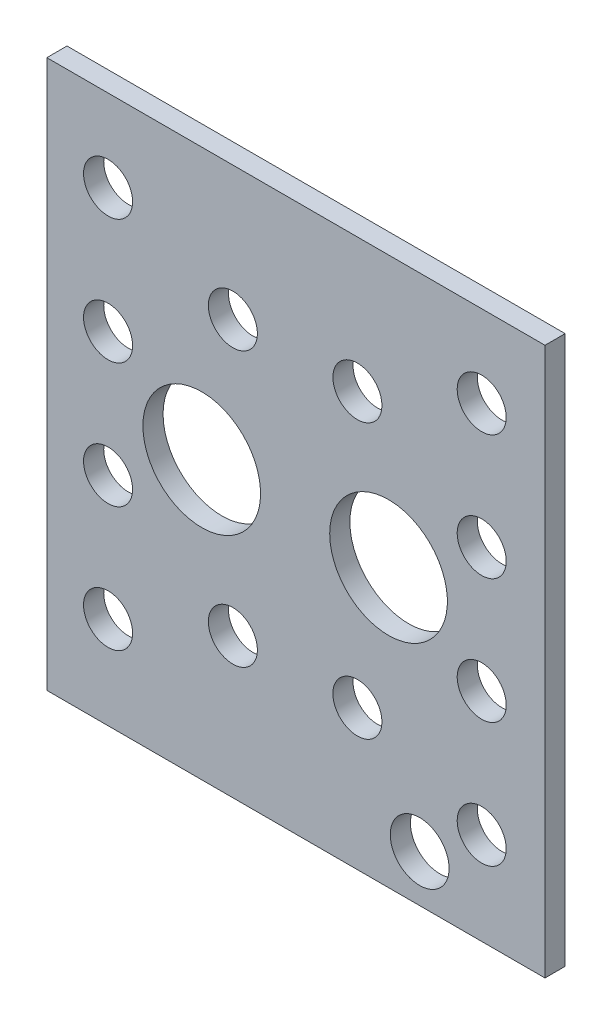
ISO-10303-21;
HEADER;
FILE_DESCRIPTION(('STEP AP214'),'2;1');
FILE_NAME('part.step','',(''),(''),'','','');
FILE_SCHEMA(('AUTOMOTIVE_DESIGN { 1 0 10303 214 1 1 1 1 }'));
ENDSEC;
DATA;
#1=APPLICATION_CONTEXT('core data for automotive mechanical design processes');
#2=APPLICATION_PROTOCOL_DEFINITION('international standard','automotive_design',2000,#1);
#3=PRODUCT_CONTEXT('',#1,'mechanical');
#4=PRODUCT('Part','Part','',(#3));
#5=PRODUCT_RELATED_PRODUCT_CATEGORY('part','',(#4));
#6=PRODUCT_DEFINITION_FORMATION('','',#4);
#7=PRODUCT_DEFINITION_CONTEXT('part definition',#1,'design');
#8=PRODUCT_DEFINITION('design','',#6,#7);
#9=PRODUCT_DEFINITION_SHAPE('','',#8);
#10=(LENGTH_UNIT() NAMED_UNIT(*) SI_UNIT(.MILLI.,.METRE.));
#11=(NAMED_UNIT(*) PLANE_ANGLE_UNIT() SI_UNIT($,.RADIAN.));
#12=(NAMED_UNIT(*) SI_UNIT($,.STERADIAN.) SOLID_ANGLE_UNIT());
#13=UNCERTAINTY_MEASURE_WITH_UNIT(LENGTH_MEASURE(1.E-05),#10,'distance_accuracy_value','');
#14=(GEOMETRIC_REPRESENTATION_CONTEXT(3) GLOBAL_UNCERTAINTY_ASSIGNED_CONTEXT((#13)) GLOBAL_UNIT_ASSIGNED_CONTEXT((#10,
#11,#12)) REPRESENTATION_CONTEXT('',''));
#15=CARTESIAN_POINT('',(0.,0.,0.));
#16=DIRECTION('',(0.,0.,1.));
#17=DIRECTION('',(1.,0.,0.));
#18=AXIS2_PLACEMENT_3D('',#15,#16,#17);
#19=CARTESIAN_POINT('',(-7.112,-5.588,0.));
#20=DIRECTION('',(0.,0.,1.));
#21=DIRECTION('',(1.,0.,0.));
#22=AXIS2_PLACEMENT_3D('',#19,#20,#21);
#23=PLANE('',#22);
#24=CARTESIAN_POINT('',(1.75699928,3.91599928,0.));
#25=DIRECTION('',(0.,0.,-1.));
#26=DIRECTION('',(-1.,0.,0.));
#27=AXIS2_PLACEMENT_3D('',#24,#25,#26);
#28=CIRCLE('',#27,0.499999);
#29=CARTESIAN_POINT('',(1.25700028,3.91599928,0.));
#30=VERTEX_POINT('',#29);
#31=EDGE_CURVE('E144',#30,#30,#28,.T.);
#32=ORIENTED_EDGE('',*,*,#31,.T.);
#33=EDGE_LOOP('',(#32));
#34=FACE_BOUND('',#33,.T.);
#35=CARTESIAN_POINT('',(1.75699928,1.37599928,0.));
#36=DIRECTION('',(0.,0.,-1.));
#37=DIRECTION('',(-1.,0.,0.));
#38=AXIS2_PLACEMENT_3D('',#35,#36,#37);
#39=CIRCLE('',#38,0.499999);
#40=CARTESIAN_POINT('',(1.25700028,1.37599928,0.));
#41=VERTEX_POINT('',#40);
#42=EDGE_CURVE('E148',#41,#41,#39,.T.);
#43=ORIENTED_EDGE('',*,*,#42,.T.);
#44=EDGE_LOOP('',(#43));
#45=FACE_BOUND('',#44,.T.);
#46=CARTESIAN_POINT('',(-0.77799946,2.86100012,0.));
#47=DIRECTION('',(0.,0.,-1.));
#48=DIRECTION('',(-1.,0.,0.));
#49=AXIS2_PLACEMENT_3D('',#46,#47,#48);
#50=CIRCLE('',#49,0.499999);
#51=CARTESIAN_POINT('',(-1.27799846,2.86100012,0.));
#52=VERTEX_POINT('',#51);
#53=EDGE_CURVE('E152',#52,#52,#50,.T.);
#54=ORIENTED_EDGE('',*,*,#53,.T.);
#55=EDGE_LOOP('',(#54));
#56=FACE_BOUND('',#55,.T.);
#57=CARTESIAN_POINT('',(-0.14299946,0.06700012,0.));
#58=DIRECTION('',(0.,0.,-1.));
#59=DIRECTION('',(-1.,0.,0.));
#60=AXIS2_PLACEMENT_3D('',#57,#58,#59);
#61=CIRCLE('',#60,1.20000014);
#62=CARTESIAN_POINT('',(-1.3429996,0.06700012,0.));
#63=VERTEX_POINT('',#62);
#64=EDGE_CURVE('E156',#63,#63,#61,.T.);
#65=ORIENTED_EDGE('',*,*,#64,.T.);
#66=EDGE_LOOP('',(#65));
#67=FACE_BOUND('',#66,.T.);
#68=CARTESIAN_POINT('',(1.75699928,-1.16400072,0.));
#69=DIRECTION('',(0.,0.,-1.));
#70=DIRECTION('',(-1.,0.,0.));
#71=AXIS2_PLACEMENT_3D('',#68,#69,#70);
#72=CIRCLE('',#71,0.499999);
#73=CARTESIAN_POINT('',(1.25700028,-1.16400072,0.));
#74=VERTEX_POINT('',#73);
#75=EDGE_CURVE('E160',#74,#74,#72,.T.);
#76=ORIENTED_EDGE('',*,*,#75,.T.);
#77=EDGE_LOOP('',(#76));
#78=FACE_BOUND('',#77,.T.);
#79=CARTESIAN_POINT('',(1.75699928,-3.70400072,0.));
#80=DIRECTION('',(0.,0.,-1.));
#81=DIRECTION('',(-1.,0.,0.));
#82=AXIS2_PLACEMENT_3D('',#79,#80,#81);
#83=CIRCLE('',#82,0.499999);
#84=CARTESIAN_POINT('',(1.25700028,-3.70400072,0.));
#85=VERTEX_POINT('',#84);
#86=EDGE_CURVE('E164',#85,#85,#83,.T.);
#87=ORIENTED_EDGE('',*,*,#86,.T.);
#88=EDGE_LOOP('',(#87));
#89=FACE_BOUND('',#88,.T.);
#90=CARTESIAN_POINT('',(-0.77799946,-2.72699988,0.));
#91=DIRECTION('',(0.,0.,-1.));
#92=DIRECTION('',(-1.,0.,0.));
#93=AXIS2_PLACEMENT_3D('',#90,#91,#92);
#94=CIRCLE('',#93,0.499999);
#95=CARTESIAN_POINT('',(-1.27799846,-2.72699988,0.));
#96=VERTEX_POINT('',#95);
#97=EDGE_CURVE('E168',#96,#96,#94,.T.);
#98=ORIENTED_EDGE('',*,*,#97,.T.);
#99=EDGE_LOOP('',(#98));
#100=FACE_BOUND('',#99,.T.);
#101=CARTESIAN_POINT('',(0.49200054,-4.63199988,0.));
#102=DIRECTION('',(0.,0.,-1.));
#103=DIRECTION('',(-1.,0.,0.));
#104=AXIS2_PLACEMENT_3D('',#101,#102,#103);
#105=CIRCLE('',#104,0.5999988);
#106=CARTESIAN_POINT('',(-0.10799826,-4.63199988,0.));
#107=VERTEX_POINT('',#106);
#108=EDGE_CURVE('E172',#107,#107,#105,.T.);
#109=ORIENTED_EDGE('',*,*,#108,.T.);
#110=EDGE_LOOP('',(#109));
#111=FACE_BOUND('',#110,.T.);
#112=CARTESIAN_POINT('',(-3.31799946,2.86100012,0.));
#113=DIRECTION('',(0.,0.,-1.));
#114=DIRECTION('',(-1.,0.,0.));
#115=AXIS2_PLACEMENT_3D('',#112,#113,#114);
#116=CIRCLE('',#115,0.499999);
#117=CARTESIAN_POINT('',(-3.81799846,2.86100012,0.));
#118=VERTEX_POINT('',#117);
#119=EDGE_CURVE('E176',#118,#118,#116,.T.);
#120=ORIENTED_EDGE('',*,*,#119,.T.);
#121=EDGE_LOOP('',(#120));
#122=FACE_BOUND('',#121,.T.);
#123=CARTESIAN_POINT('',(-3.95299946,0.06700012,0.));
#124=DIRECTION('',(0.,0.,-1.));
#125=DIRECTION('',(-1.,0.,0.));
#126=AXIS2_PLACEMENT_3D('',#123,#124,#125);
#127=CIRCLE('',#126,1.20000014);
#128=CARTESIAN_POINT('',(-5.1529996,0.06700012,0.));
#129=VERTEX_POINT('',#128);
#130=EDGE_CURVE('E180',#129,#129,#127,.T.);
#131=ORIENTED_EDGE('',*,*,#130,.T.);
#132=EDGE_LOOP('',(#131));
#133=FACE_BOUND('',#132,.T.);
#134=CARTESIAN_POINT('',(-5.86300072,3.91599928,0.));
#135=DIRECTION('',(0.,0.,-1.));
#136=DIRECTION('',(-1.,0.,0.));
#137=AXIS2_PLACEMENT_3D('',#134,#135,#136);
#138=CIRCLE('',#137,0.499999);
#139=CARTESIAN_POINT('',(-6.36299972,3.91599928,0.));
#140=VERTEX_POINT('',#139);
#141=EDGE_CURVE('E184',#140,#140,#138,.T.);
#142=ORIENTED_EDGE('',*,*,#141,.T.);
#143=EDGE_LOOP('',(#142));
#144=FACE_BOUND('',#143,.T.);
#145=CARTESIAN_POINT('',(-5.86300072,1.37599928,0.));
#146=DIRECTION('',(0.,0.,-1.));
#147=DIRECTION('',(-1.,0.,0.));
#148=AXIS2_PLACEMENT_3D('',#145,#146,#147);
#149=CIRCLE('',#148,0.499999);
#150=CARTESIAN_POINT('',(-6.36299972,1.37599928,0.));
#151=VERTEX_POINT('',#150);
#152=EDGE_CURVE('E188',#151,#151,#149,.T.);
#153=ORIENTED_EDGE('',*,*,#152,.T.);
#154=EDGE_LOOP('',(#153));
#155=FACE_BOUND('',#154,.T.);
#156=CARTESIAN_POINT('',(-5.86300072,-1.16400072,0.));
#157=DIRECTION('',(0.,0.,-1.));
#158=DIRECTION('',(-1.,0.,0.));
#159=AXIS2_PLACEMENT_3D('',#156,#157,#158);
#160=CIRCLE('',#159,0.499999);
#161=CARTESIAN_POINT('',(-6.36299972,-1.16400072,0.));
#162=VERTEX_POINT('',#161);
#163=EDGE_CURVE('E192',#162,#162,#160,.T.);
#164=ORIENTED_EDGE('',*,*,#163,.T.);
#165=EDGE_LOOP('',(#164));
#166=FACE_BOUND('',#165,.T.);
#167=CARTESIAN_POINT('',(-3.31799946,-2.72699988,0.));
#168=DIRECTION('',(0.,0.,-1.));
#169=DIRECTION('',(-1.,0.,0.));
#170=AXIS2_PLACEMENT_3D('',#167,#168,#169);
#171=CIRCLE('',#170,0.499999);
#172=CARTESIAN_POINT('',(-3.81799846,-2.72699988,0.));
#173=VERTEX_POINT('',#172);
#174=EDGE_CURVE('E195',#173,#173,#171,.T.);
#175=ORIENTED_EDGE('',*,*,#174,.T.);
#176=EDGE_LOOP('',(#175));
#177=FACE_BOUND('',#176,.T.);
#178=CARTESIAN_POINT('',(-5.86300072,-3.70400072,0.));
#179=DIRECTION('',(0.,0.,-1.));
#180=DIRECTION('',(-1.,0.,0.));
#181=AXIS2_PLACEMENT_3D('',#178,#179,#180);
#182=CIRCLE('',#181,0.499999);
#183=CARTESIAN_POINT('',(-6.36299972,-3.70400072,0.));
#184=VERTEX_POINT('',#183);
#185=EDGE_CURVE('E19',#184,#184,#182,.T.);
#186=ORIENTED_EDGE('',*,*,#185,.T.);
#187=EDGE_LOOP('',(#186));
#188=FACE_BOUND('',#187,.T.);
#189=DIRECTION('',(1.,0.,0.));
#190=VECTOR('',#189,1.);
#191=CARTESIAN_POINT('',(-7.112,5.588,0.));
#192=LINE('',#191,#190);
#193=CARTESIAN_POINT('',(-7.112,5.588,0.));
#194=VERTEX_POINT('',#193);
#195=CARTESIAN_POINT('',(3.048,5.588,0.));
#196=VERTEX_POINT('',#195);
#197=EDGE_CURVE('E54',#194,#196,#192,.T.);
#198=ORIENTED_EDGE('',*,*,#197,.F.);
#199=DIRECTION('',(0.,1.,0.));
#200=VECTOR('',#199,1.);
#201=CARTESIAN_POINT('',(-7.112,-5.588,0.));
#202=LINE('',#201,#200);
#203=CARTESIAN_POINT('',(-7.112,-5.588,0.));
#204=VERTEX_POINT('',#203);
#205=EDGE_CURVE('E72',#204,#194,#202,.T.);
#206=ORIENTED_EDGE('',*,*,#205,.F.);
#207=DIRECTION('',(1.,0.,0.));
#208=VECTOR('',#207,1.);
#209=CARTESIAN_POINT('',(3.048,-5.588,0.));
#210=LINE('',#209,#208);
#211=CARTESIAN_POINT('',(3.048,-5.588,0.));
#212=VERTEX_POINT('',#211);
#213=EDGE_CURVE('E69',#212,#204,#210,.F.);
#214=ORIENTED_EDGE('',*,*,#213,.F.);
#215=DIRECTION('',(0.,1.,0.));
#216=VECTOR('',#215,1.);
#217=CARTESIAN_POINT('',(3.048,5.588,0.));
#218=LINE('',#217,#216);
#219=EDGE_CURVE('E59',#196,#212,#218,.F.);
#220=ORIENTED_EDGE('',*,*,#219,.F.);
#221=EDGE_LOOP('',(#198,#206,#214,#220));
#222=FACE_BOUND('',#221,.T.);
#223=ADVANCED_FACE('F16',(#34,#45,#56,#67,#78,#89,#100,#111,#122,#133,#144,#155,#166,#177,#188,
#222),#23,.T.);
#224=CARTESIAN_POINT('',(3.048,-5.588,-0.41148));
#225=DIRECTION('',(0.,-1.,0.));
#226=DIRECTION('',(0.,0.,-1.));
#227=AXIS2_PLACEMENT_3D('',#224,#225,#226);
#228=PLANE('',#227);
#229=DIRECTION('',(0.,0.,1.));
#230=VECTOR('',#229,1.);
#231=CARTESIAN_POINT('',(-7.112,-5.588,-0.41148));
#232=LINE('',#231,#230);
#233=CARTESIAN_POINT('',(-7.112,-5.588,-0.41148));
#234=VERTEX_POINT('',#233);
#235=EDGE_CURVE('E207',#234,#204,#232,.T.);
#236=ORIENTED_EDGE('',*,*,#235,.F.);
#237=DIRECTION('',(1.,0.,0.));
#238=VECTOR('',#237,1.);
#239=CARTESIAN_POINT('',(-7.112,-5.588,-0.41148));
#240=LINE('',#239,#238);
#241=CARTESIAN_POINT('',(3.048,-5.588,-0.41148));
#242=VERTEX_POINT('',#241);
#243=EDGE_CURVE('E80',#234,#242,#240,.T.);
#244=ORIENTED_EDGE('',*,*,#243,.T.);
#245=DIRECTION('',(0.,0.,-1.));
#246=VECTOR('',#245,1.);
#247=CARTESIAN_POINT('',(3.048,-5.588,-0.41148));
#248=LINE('',#247,#246);
#249=EDGE_CURVE('E64',#212,#242,#248,.T.);
#250=ORIENTED_EDGE('',*,*,#249,.F.);
#251=ORIENTED_EDGE('',*,*,#213,.T.);
#252=EDGE_LOOP('',(#236,#244,#250,#251));
#253=FACE_BOUND('',#252,.T.);
#254=ADVANCED_FACE('F79',(#253),#228,.T.);
#255=CARTESIAN_POINT('',(3.048,5.588,-0.41148));
#256=DIRECTION('',(1.,0.,0.));
#257=DIRECTION('',(0.,0.,-1.));
#258=AXIS2_PLACEMENT_3D('',#255,#256,#257);
#259=PLANE('',#258);
#260=ORIENTED_EDGE('',*,*,#249,.T.);
#261=DIRECTION('',(0.,1.,0.));
#262=VECTOR('',#261,1.);
#263=CARTESIAN_POINT('',(3.048,-5.588,-0.41148));
#264=LINE('',#263,#262);
#265=CARTESIAN_POINT('',(3.048,5.588,-0.41148));
#266=VERTEX_POINT('',#265);
#267=EDGE_CURVE('E220',#242,#266,#264,.T.);
#268=ORIENTED_EDGE('',*,*,#267,.T.);
#269=DIRECTION('',(0.,0.,1.));
#270=VECTOR('',#269,1.);
#271=CARTESIAN_POINT('',(3.048,5.588,-0.41148));
#272=LINE('',#271,#270);
#273=EDGE_CURVE('E66',#196,#266,#272,.F.);
#274=ORIENTED_EDGE('',*,*,#273,.F.);
#275=ORIENTED_EDGE('',*,*,#219,.T.);
#276=EDGE_LOOP('',(#260,#268,#274,#275));
#277=FACE_BOUND('',#276,.T.);
#278=ADVANCED_FACE('F61',(#277),#259,.T.);
#279=CARTESIAN_POINT('',(-7.112,5.588,-0.41148));
#280=DIRECTION('',(0.,1.,0.));
#281=DIRECTION('',(0.,0.,1.));
#282=AXIS2_PLACEMENT_3D('',#279,#280,#281);
#283=PLANE('',#282);
#284=ORIENTED_EDGE('',*,*,#273,.T.);
#285=DIRECTION('',(1.,0.,0.));
#286=VECTOR('',#285,1.);
#287=CARTESIAN_POINT('',(-7.112,5.588,-0.41148));
#288=LINE('',#287,#286);
#289=CARTESIAN_POINT('',(-7.112,5.588,-0.41148));
#290=VERTEX_POINT('',#289);
#291=EDGE_CURVE('E217',#266,#290,#288,.F.);
#292=ORIENTED_EDGE('',*,*,#291,.T.);
#293=DIRECTION('',(0.,0.,1.));
#294=VECTOR('',#293,1.);
#295=CARTESIAN_POINT('',(-7.112,5.588,-0.41148));
#296=LINE('',#295,#294);
#297=EDGE_CURVE('E35',#194,#290,#296,.F.);
#298=ORIENTED_EDGE('',*,*,#297,.F.);
#299=ORIENTED_EDGE('',*,*,#197,.T.);
#300=EDGE_LOOP('',(#284,#292,#298,#299));
#301=FACE_BOUND('',#300,.T.);
#302=ADVANCED_FACE('F216',(#301),#283,.T.);
#303=CARTESIAN_POINT('',(-7.112,-5.588,-0.41148));
#304=DIRECTION('',(-1.,0.,0.));
#305=DIRECTION('',(0.,0.,1.));
#306=AXIS2_PLACEMENT_3D('',#303,#304,#305);
#307=PLANE('',#306);
#308=ORIENTED_EDGE('',*,*,#297,.T.);
#309=DIRECTION('',(0.,1.,0.));
#310=VECTOR('',#309,1.);
#311=CARTESIAN_POINT('',(-7.112,-5.588,-0.41148));
#312=LINE('',#311,#310);
#313=EDGE_CURVE('E143',#290,#234,#312,.F.);
#314=ORIENTED_EDGE('',*,*,#313,.T.);
#315=ORIENTED_EDGE('',*,*,#235,.T.);
#316=ORIENTED_EDGE('',*,*,#205,.T.);
#317=EDGE_LOOP('',(#308,#314,#315,#316));
#318=FACE_BOUND('',#317,.T.);
#319=ADVANCED_FACE('F227',(#318),#307,.T.);
#320=CARTESIAN_POINT('',(-5.86300072,-3.70400072,-0.41148));
#321=DIRECTION('',(0.,0.,-1.));
#322=DIRECTION('',(-1.,0.,0.));
#323=AXIS2_PLACEMENT_3D('',#320,#321,#322);
#324=CYLINDRICAL_SURFACE('',#323,0.499999);
#325=ORIENTED_EDGE('',*,*,#185,.F.);
#326=EDGE_LOOP('',(#325));
#327=FACE_BOUND('',#326,.T.);
#328=CARTESIAN_POINT('',(-5.86300072,-3.70400072,-0.41148));
#329=DIRECTION('',(0.,0.,-1.));
#330=DIRECTION('',(-1.,0.,0.));
#331=AXIS2_PLACEMENT_3D('',#328,#329,#330);
#332=CIRCLE('',#331,0.499999);
#333=CARTESIAN_POINT('',(-6.36299972,-3.70400072,-0.41148));
#334=VERTEX_POINT('',#333);
#335=EDGE_CURVE('E139',#334,#334,#332,.T.);
#336=ORIENTED_EDGE('',*,*,#335,.T.);
#337=EDGE_LOOP('',(#336));
#338=FACE_BOUND('',#337,.T.);
#339=ADVANCED_FACE('F229',(#327,#338),#324,.F.);
#340=CARTESIAN_POINT('',(-3.31799946,-2.72699988,-0.41148));
#341=DIRECTION('',(0.,0.,-1.));
#342=DIRECTION('',(-1.,0.,0.));
#343=AXIS2_PLACEMENT_3D('',#340,#341,#342);
#344=CYLINDRICAL_SURFACE('',#343,0.499999);
#345=ORIENTED_EDGE('',*,*,#174,.F.);
#346=EDGE_LOOP('',(#345));
#347=FACE_BOUND('',#346,.T.);
#348=CARTESIAN_POINT('',(-3.31799946,-2.72699988,-0.41148));
#349=DIRECTION('',(0.,0.,-1.));
#350=DIRECTION('',(-1.,0.,0.));
#351=AXIS2_PLACEMENT_3D('',#348,#349,#350);
#352=CIRCLE('',#351,0.499999);
#353=CARTESIAN_POINT('',(-3.81799846,-2.72699988,-0.41148));
#354=VERTEX_POINT('',#353);
#355=EDGE_CURVE('E135',#354,#354,#352,.T.);
#356=ORIENTED_EDGE('',*,*,#355,.T.);
#357=EDGE_LOOP('',(#356));
#358=FACE_BOUND('',#357,.T.);
#359=ADVANCED_FACE('F235',(#347,#358),#344,.F.);
#360=CARTESIAN_POINT('',(-5.86300072,-1.16400072,-0.41148));
#361=DIRECTION('',(0.,0.,-1.));
#362=DIRECTION('',(-1.,0.,0.));
#363=AXIS2_PLACEMENT_3D('',#360,#361,#362);
#364=CYLINDRICAL_SURFACE('',#363,0.499999);
#365=ORIENTED_EDGE('',*,*,#163,.F.);
#366=EDGE_LOOP('',(#365));
#367=FACE_BOUND('',#366,.T.);
#368=CARTESIAN_POINT('',(-5.86300072,-1.16400072,-0.41148));
#369=DIRECTION('',(0.,0.,-1.));
#370=DIRECTION('',(-1.,0.,0.));
#371=AXIS2_PLACEMENT_3D('',#368,#369,#370);
#372=CIRCLE('',#371,0.499999);
#373=CARTESIAN_POINT('',(-6.36299972,-1.16400072,-0.41148));
#374=VERTEX_POINT('',#373);
#375=EDGE_CURVE('E131',#374,#374,#372,.T.);
#376=ORIENTED_EDGE('',*,*,#375,.T.);
#377=EDGE_LOOP('',(#376));
#378=FACE_BOUND('',#377,.T.);
#379=ADVANCED_FACE('F293',(#367,#378),#364,.F.);
#380=CARTESIAN_POINT('',(-5.86300072,1.37599928,-0.41148));
#381=DIRECTION('',(0.,0.,-1.));
#382=DIRECTION('',(-1.,0.,0.));
#383=AXIS2_PLACEMENT_3D('',#380,#381,#382);
#384=CYLINDRICAL_SURFACE('',#383,0.499999);
#385=ORIENTED_EDGE('',*,*,#152,.F.);
#386=EDGE_LOOP('',(#385));
#387=FACE_BOUND('',#386,.T.);
#388=CARTESIAN_POINT('',(-5.86300072,1.37599928,-0.41148));
#389=DIRECTION('',(0.,0.,-1.));
#390=DIRECTION('',(-1.,0.,0.));
#391=AXIS2_PLACEMENT_3D('',#388,#389,#390);
#392=CIRCLE('',#391,0.499999);
#393=CARTESIAN_POINT('',(-6.36299972,1.37599928,-0.41148));
#394=VERTEX_POINT('',#393);
#395=EDGE_CURVE('E127',#394,#394,#392,.T.);
#396=ORIENTED_EDGE('',*,*,#395,.T.);
#397=EDGE_LOOP('',(#396));
#398=FACE_BOUND('',#397,.T.);
#399=ADVANCED_FACE('F289',(#387,#398),#384,.F.);
#400=CARTESIAN_POINT('',(-5.86300072,3.91599928,-0.41148));
#401=DIRECTION('',(0.,0.,-1.));
#402=DIRECTION('',(-1.,0.,0.));
#403=AXIS2_PLACEMENT_3D('',#400,#401,#402);
#404=CYLINDRICAL_SURFACE('',#403,0.499999);
#405=ORIENTED_EDGE('',*,*,#141,.F.);
#406=EDGE_LOOP('',(#405));
#407=FACE_BOUND('',#406,.T.);
#408=CARTESIAN_POINT('',(-5.86300072,3.91599928,-0.41148));
#409=DIRECTION('',(0.,0.,-1.));
#410=DIRECTION('',(-1.,0.,0.));
#411=AXIS2_PLACEMENT_3D('',#408,#409,#410);
#412=CIRCLE('',#411,0.499999);
#413=CARTESIAN_POINT('',(-6.36299972,3.91599928,-0.41148));
#414=VERTEX_POINT('',#413);
#415=EDGE_CURVE('E123',#414,#414,#412,.T.);
#416=ORIENTED_EDGE('',*,*,#415,.T.);
#417=EDGE_LOOP('',(#416));
#418=FACE_BOUND('',#417,.T.);
#419=ADVANCED_FACE('F285',(#407,#418),#404,.F.);
#420=CARTESIAN_POINT('',(-3.95299946,0.06700012,-0.41148));
#421=DIRECTION('',(0.,0.,-1.));
#422=DIRECTION('',(-1.,0.,0.));
#423=AXIS2_PLACEMENT_3D('',#420,#421,#422);
#424=CYLINDRICAL_SURFACE('',#423,1.20000014);
#425=ORIENTED_EDGE('',*,*,#130,.F.);
#426=EDGE_LOOP('',(#425));
#427=FACE_BOUND('',#426,.T.);
#428=CARTESIAN_POINT('',(-3.95299946,0.06700012,-0.41148));
#429=DIRECTION('',(0.,0.,-1.));
#430=DIRECTION('',(-1.,0.,0.));
#431=AXIS2_PLACEMENT_3D('',#428,#429,#430);
#432=CIRCLE('',#431,1.20000014);
#433=CARTESIAN_POINT('',(-5.1529996,0.06700012,-0.41148));
#434=VERTEX_POINT('',#433);
#435=EDGE_CURVE('E119',#434,#434,#432,.T.);
#436=ORIENTED_EDGE('',*,*,#435,.T.);
#437=EDGE_LOOP('',(#436));
#438=FACE_BOUND('',#437,.T.);
#439=ADVANCED_FACE('F281',(#427,#438),#424,.F.);
#440=CARTESIAN_POINT('',(-3.31799946,2.86100012,-0.41148));
#441=DIRECTION('',(0.,0.,-1.));
#442=DIRECTION('',(-1.,0.,0.));
#443=AXIS2_PLACEMENT_3D('',#440,#441,#442);
#444=CYLINDRICAL_SURFACE('',#443,0.499999);
#445=ORIENTED_EDGE('',*,*,#119,.F.);
#446=EDGE_LOOP('',(#445));
#447=FACE_BOUND('',#446,.T.);
#448=CARTESIAN_POINT('',(-3.31799946,2.86100012,-0.41148));
#449=DIRECTION('',(0.,0.,-1.));
#450=DIRECTION('',(-1.,0.,0.));
#451=AXIS2_PLACEMENT_3D('',#448,#449,#450);
#452=CIRCLE('',#451,0.499999);
#453=CARTESIAN_POINT('',(-3.81799846,2.86100012,-0.41148));
#454=VERTEX_POINT('',#453);
#455=EDGE_CURVE('E115',#454,#454,#452,.T.);
#456=ORIENTED_EDGE('',*,*,#455,.T.);
#457=EDGE_LOOP('',(#456));
#458=FACE_BOUND('',#457,.T.);
#459=ADVANCED_FACE('F277',(#447,#458),#444,.F.);
#460=CARTESIAN_POINT('',(0.49200054,-4.63199988,-0.41148));
#461=DIRECTION('',(0.,0.,-1.));
#462=DIRECTION('',(-1.,0.,0.));
#463=AXIS2_PLACEMENT_3D('',#460,#461,#462);
#464=CYLINDRICAL_SURFACE('',#463,0.5999988);
#465=ORIENTED_EDGE('',*,*,#108,.F.);
#466=EDGE_LOOP('',(#465));
#467=FACE_BOUND('',#466,.T.);
#468=CARTESIAN_POINT('',(0.49200054,-4.63199988,-0.41148));
#469=DIRECTION('',(0.,0.,-1.));
#470=DIRECTION('',(-1.,0.,0.));
#471=AXIS2_PLACEMENT_3D('',#468,#469,#470);
#472=CIRCLE('',#471,0.5999988);
#473=CARTESIAN_POINT('',(-0.10799826,-4.63199988,-0.41148));
#474=VERTEX_POINT('',#473);
#475=EDGE_CURVE('E111',#474,#474,#472,.T.);
#476=ORIENTED_EDGE('',*,*,#475,.T.);
#477=EDGE_LOOP('',(#476));
#478=FACE_BOUND('',#477,.T.);
#479=ADVANCED_FACE('F273',(#467,#478),#464,.F.);
#480=CARTESIAN_POINT('',(-0.77799946,-2.72699988,-0.41148));
#481=DIRECTION('',(0.,0.,-1.));
#482=DIRECTION('',(-1.,0.,0.));
#483=AXIS2_PLACEMENT_3D('',#480,#481,#482);
#484=CYLINDRICAL_SURFACE('',#483,0.499999);
#485=ORIENTED_EDGE('',*,*,#97,.F.);
#486=EDGE_LOOP('',(#485));
#487=FACE_BOUND('',#486,.T.);
#488=CARTESIAN_POINT('',(-0.77799946,-2.72699988,-0.41148));
#489=DIRECTION('',(0.,0.,-1.));
#490=DIRECTION('',(-1.,0.,0.));
#491=AXIS2_PLACEMENT_3D('',#488,#489,#490);
#492=CIRCLE('',#491,0.499999);
#493=CARTESIAN_POINT('',(-1.27799846,-2.72699988,-0.41148));
#494=VERTEX_POINT('',#493);
#495=EDGE_CURVE('E107',#494,#494,#492,.T.);
#496=ORIENTED_EDGE('',*,*,#495,.T.);
#497=EDGE_LOOP('',(#496));
#498=FACE_BOUND('',#497,.T.);
#499=ADVANCED_FACE('F269',(#487,#498),#484,.F.);
#500=CARTESIAN_POINT('',(1.75699928,-3.70400072,-0.41148));
#501=DIRECTION('',(0.,0.,-1.));
#502=DIRECTION('',(-1.,0.,0.));
#503=AXIS2_PLACEMENT_3D('',#500,#501,#502);
#504=CYLINDRICAL_SURFACE('',#503,0.499999);
#505=ORIENTED_EDGE('',*,*,#86,.F.);
#506=EDGE_LOOP('',(#505));
#507=FACE_BOUND('',#506,.T.);
#508=CARTESIAN_POINT('',(1.75699928,-3.70400072,-0.41148));
#509=DIRECTION('',(0.,0.,-1.));
#510=DIRECTION('',(-1.,0.,0.));
#511=AXIS2_PLACEMENT_3D('',#508,#509,#510);
#512=CIRCLE('',#511,0.499999);
#513=CARTESIAN_POINT('',(1.25700028,-3.70400072,-0.41148));
#514=VERTEX_POINT('',#513);
#515=EDGE_CURVE('E103',#514,#514,#512,.T.);
#516=ORIENTED_EDGE('',*,*,#515,.T.);
#517=EDGE_LOOP('',(#516));
#518=FACE_BOUND('',#517,.T.);
#519=ADVANCED_FACE('F265',(#507,#518),#504,.F.);
#520=CARTESIAN_POINT('',(1.75699928,-1.16400072,-0.41148));
#521=DIRECTION('',(0.,0.,-1.));
#522=DIRECTION('',(-1.,0.,0.));
#523=AXIS2_PLACEMENT_3D('',#520,#521,#522);
#524=CYLINDRICAL_SURFACE('',#523,0.499999);
#525=ORIENTED_EDGE('',*,*,#75,.F.);
#526=EDGE_LOOP('',(#525));
#527=FACE_BOUND('',#526,.T.);
#528=CARTESIAN_POINT('',(1.75699928,-1.16400072,-0.41148));
#529=DIRECTION('',(0.,0.,-1.));
#530=DIRECTION('',(-1.,0.,0.));
#531=AXIS2_PLACEMENT_3D('',#528,#529,#530);
#532=CIRCLE('',#531,0.499999);
#533=CARTESIAN_POINT('',(1.25700028,-1.16400072,-0.41148));
#534=VERTEX_POINT('',#533);
#535=EDGE_CURVE('E99',#534,#534,#532,.T.);
#536=ORIENTED_EDGE('',*,*,#535,.T.);
#537=EDGE_LOOP('',(#536));
#538=FACE_BOUND('',#537,.T.);
#539=ADVANCED_FACE('F261',(#527,#538),#524,.F.);
#540=CARTESIAN_POINT('',(-0.14299946,0.06700012,-0.41148));
#541=DIRECTION('',(0.,0.,-1.));
#542=DIRECTION('',(-1.,0.,0.));
#543=AXIS2_PLACEMENT_3D('',#540,#541,#542);
#544=CYLINDRICAL_SURFACE('',#543,1.20000014);
#545=ORIENTED_EDGE('',*,*,#64,.F.);
#546=EDGE_LOOP('',(#545));
#547=FACE_BOUND('',#546,.T.);
#548=CARTESIAN_POINT('',(-0.14299946,0.06700012,-0.41148));
#549=DIRECTION('',(0.,0.,-1.));
#550=DIRECTION('',(-1.,0.,0.));
#551=AXIS2_PLACEMENT_3D('',#548,#549,#550);
#552=CIRCLE('',#551,1.20000014);
#553=CARTESIAN_POINT('',(-1.3429996,0.06700012,-0.41148));
#554=VERTEX_POINT('',#553);
#555=EDGE_CURVE('E95',#554,#554,#552,.T.);
#556=ORIENTED_EDGE('',*,*,#555,.T.);
#557=EDGE_LOOP('',(#556));
#558=FACE_BOUND('',#557,.T.);
#559=ADVANCED_FACE('F257',(#547,#558),#544,.F.);
#560=CARTESIAN_POINT('',(-0.77799946,2.86100012,-0.41148));
#561=DIRECTION('',(0.,0.,-1.));
#562=DIRECTION('',(-1.,0.,0.));
#563=AXIS2_PLACEMENT_3D('',#560,#561,#562);
#564=CYLINDRICAL_SURFACE('',#563,0.499999);
#565=ORIENTED_EDGE('',*,*,#53,.F.);
#566=EDGE_LOOP('',(#565));
#567=FACE_BOUND('',#566,.T.);
#568=CARTESIAN_POINT('',(-0.77799946,2.86100012,-0.41148));
#569=DIRECTION('',(0.,0.,-1.));
#570=DIRECTION('',(-1.,0.,0.));
#571=AXIS2_PLACEMENT_3D('',#568,#569,#570);
#572=CIRCLE('',#571,0.499999);
#573=CARTESIAN_POINT('',(-1.27799846,2.86100012,-0.41148));
#574=VERTEX_POINT('',#573);
#575=EDGE_CURVE('E91',#574,#574,#572,.T.);
#576=ORIENTED_EDGE('',*,*,#575,.T.);
#577=EDGE_LOOP('',(#576));
#578=FACE_BOUND('',#577,.T.);
#579=ADVANCED_FACE('F253',(#567,#578),#564,.F.);
#580=CARTESIAN_POINT('',(1.75699928,1.37599928,-0.41148));
#581=DIRECTION('',(0.,0.,-1.));
#582=DIRECTION('',(-1.,0.,0.));
#583=AXIS2_PLACEMENT_3D('',#580,#581,#582);
#584=CYLINDRICAL_SURFACE('',#583,0.499999);
#585=ORIENTED_EDGE('',*,*,#42,.F.);
#586=EDGE_LOOP('',(#585));
#587=FACE_BOUND('',#586,.T.);
#588=CARTESIAN_POINT('',(1.75699928,1.37599928,-0.41148));
#589=DIRECTION('',(0.,0.,-1.));
#590=DIRECTION('',(-1.,0.,0.));
#591=AXIS2_PLACEMENT_3D('',#588,#589,#590);
#592=CIRCLE('',#591,0.499999);
#593=CARTESIAN_POINT('',(1.25700028,1.37599928,-0.41148));
#594=VERTEX_POINT('',#593);
#595=EDGE_CURVE('E26',#594,#594,#592,.T.);
#596=ORIENTED_EDGE('',*,*,#595,.T.);
#597=EDGE_LOOP('',(#596));
#598=FACE_BOUND('',#597,.T.);
#599=ADVANCED_FACE('F245',(#587,#598),#584,.F.);
#600=CARTESIAN_POINT('',(1.75699928,3.91599928,-0.41148));
#601=DIRECTION('',(0.,0.,-1.));
#602=DIRECTION('',(-1.,0.,0.));
#603=AXIS2_PLACEMENT_3D('',#600,#601,#602);
#604=CYLINDRICAL_SURFACE('',#603,0.499999);
#605=ORIENTED_EDGE('',*,*,#31,.F.);
#606=EDGE_LOOP('',(#605));
#607=FACE_BOUND('',#606,.T.);
#608=CARTESIAN_POINT('',(1.75699928,3.91599928,-0.41148));
#609=DIRECTION('',(0.,0.,-1.));
#610=DIRECTION('',(-1.,0.,0.));
#611=AXIS2_PLACEMENT_3D('',#608,#609,#610);
#612=CIRCLE('',#611,0.499999);
#613=CARTESIAN_POINT('',(1.25700028,3.91599928,-0.41148));
#614=VERTEX_POINT('',#613);
#615=EDGE_CURVE('E11',#614,#614,#612,.T.);
#616=ORIENTED_EDGE('',*,*,#615,.T.);
#617=EDGE_LOOP('',(#616));
#618=FACE_BOUND('',#617,.T.);
#619=ADVANCED_FACE('F240',(#607,#618),#604,.F.);
#620=CARTESIAN_POINT('',(-7.112,-5.588,-0.41148));
#621=DIRECTION('',(0.,0.,1.));
#622=DIRECTION('',(1.,0.,0.));
#623=AXIS2_PLACEMENT_3D('',#620,#621,#622);
#624=PLANE('',#623);
#625=ORIENTED_EDGE('',*,*,#615,.F.);
#626=EDGE_LOOP('',(#625));
#627=FACE_BOUND('',#626,.T.);
#628=ORIENTED_EDGE('',*,*,#595,.F.);
#629=EDGE_LOOP('',(#628));
#630=FACE_BOUND('',#629,.T.);
#631=ORIENTED_EDGE('',*,*,#575,.F.);
#632=EDGE_LOOP('',(#631));
#633=FACE_BOUND('',#632,.T.);
#634=ORIENTED_EDGE('',*,*,#555,.F.);
#635=EDGE_LOOP('',(#634));
#636=FACE_BOUND('',#635,.T.);
#637=ORIENTED_EDGE('',*,*,#535,.F.);
#638=EDGE_LOOP('',(#637));
#639=FACE_BOUND('',#638,.T.);
#640=ORIENTED_EDGE('',*,*,#515,.F.);
#641=EDGE_LOOP('',(#640));
#642=FACE_BOUND('',#641,.T.);
#643=ORIENTED_EDGE('',*,*,#495,.F.);
#644=EDGE_LOOP('',(#643));
#645=FACE_BOUND('',#644,.T.);
#646=ORIENTED_EDGE('',*,*,#475,.F.);
#647=EDGE_LOOP('',(#646));
#648=FACE_BOUND('',#647,.T.);
#649=ORIENTED_EDGE('',*,*,#455,.F.);
#650=EDGE_LOOP('',(#649));
#651=FACE_BOUND('',#650,.T.);
#652=ORIENTED_EDGE('',*,*,#435,.F.);
#653=EDGE_LOOP('',(#652));
#654=FACE_BOUND('',#653,.T.);
#655=ORIENTED_EDGE('',*,*,#415,.F.);
#656=EDGE_LOOP('',(#655));
#657=FACE_BOUND('',#656,.T.);
#658=ORIENTED_EDGE('',*,*,#395,.F.);
#659=EDGE_LOOP('',(#658));
#660=FACE_BOUND('',#659,.T.);
#661=ORIENTED_EDGE('',*,*,#375,.F.);
#662=EDGE_LOOP('',(#661));
#663=FACE_BOUND('',#662,.T.);
#664=ORIENTED_EDGE('',*,*,#355,.F.);
#665=EDGE_LOOP('',(#664));
#666=FACE_BOUND('',#665,.T.);
#667=ORIENTED_EDGE('',*,*,#335,.F.);
#668=EDGE_LOOP('',(#667));
#669=FACE_BOUND('',#668,.T.);
#670=ORIENTED_EDGE('',*,*,#291,.F.);
#671=ORIENTED_EDGE('',*,*,#267,.F.);
#672=ORIENTED_EDGE('',*,*,#243,.F.);
#673=ORIENTED_EDGE('',*,*,#313,.F.);
#674=EDGE_LOOP('',(#670,#671,#672,#673));
#675=FACE_BOUND('',#674,.T.);
#676=ADVANCED_FACE('F219',(#627,#630,#633,#636,#639,#642,#645,#648,#651,#654,#657,#660,#663,
#666,#669,#675),#624,.F.);
#677=CLOSED_SHELL('',(#223,#254,#278,#302,#319,#339,#359,#379,#399,#419,#439,#459,#479,#499,
#519,#539,#559,#579,#599,#619,#676));
#678=MANIFOLD_SOLID_BREP('B1',#677);
#679=ADVANCED_BREP_SHAPE_REPRESENTATION('',(#18,#678),#14);
#680=SHAPE_DEFINITION_REPRESENTATION(#9,#679);
ENDSEC;
END-ISO-10303-21;
